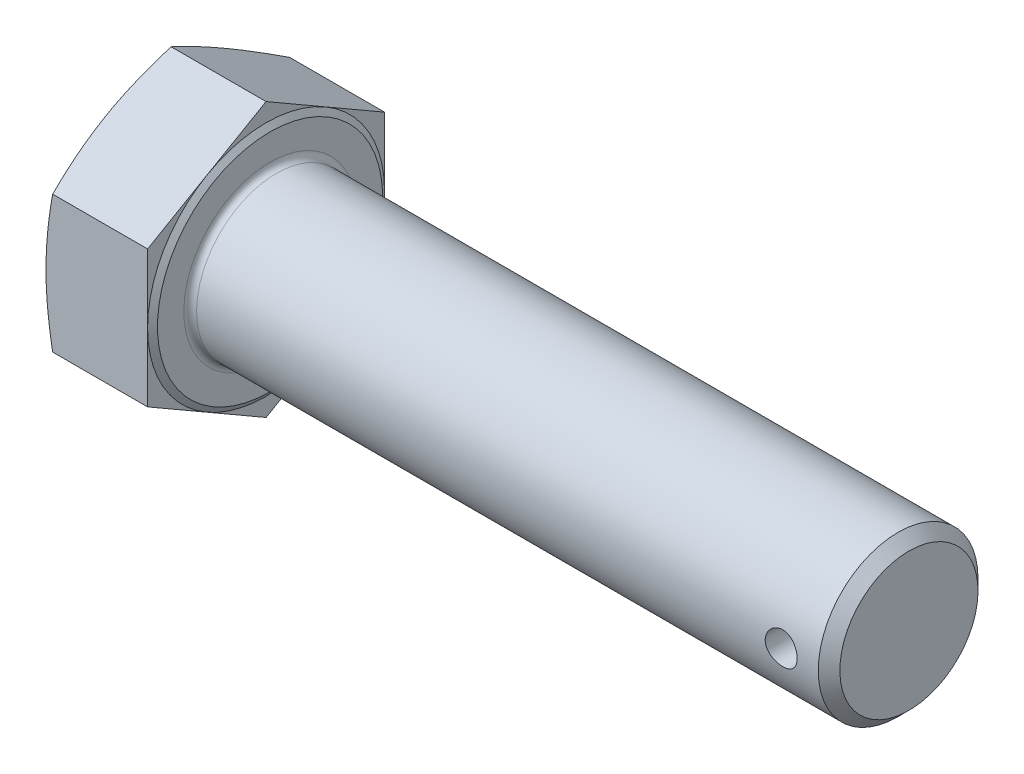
ISO-10303-21;
HEADER;
FILE_DESCRIPTION(('STEP AP214'),'2;1');
FILE_NAME('part.step','',(''),(''),'','','');
FILE_SCHEMA(('AUTOMOTIVE_DESIGN { 1 0 10303 214 1 1 1 1 }'));
ENDSEC;
DATA;
#1=APPLICATION_CONTEXT('core data for automotive mechanical design processes');
#2=APPLICATION_PROTOCOL_DEFINITION('international standard','automotive_design',2000,#1);
#3=PRODUCT_CONTEXT('',#1,'mechanical');
#4=PRODUCT('Part','Part','',(#3));
#5=PRODUCT_RELATED_PRODUCT_CATEGORY('part','',(#4));
#6=PRODUCT_DEFINITION_FORMATION('','',#4);
#7=PRODUCT_DEFINITION_CONTEXT('part definition',#1,'design');
#8=PRODUCT_DEFINITION('design','',#6,#7);
#9=PRODUCT_DEFINITION_SHAPE('','',#8);
#10=(LENGTH_UNIT() NAMED_UNIT(*) SI_UNIT(.MILLI.,.METRE.));
#11=(NAMED_UNIT(*) PLANE_ANGLE_UNIT() SI_UNIT($,.RADIAN.));
#12=(NAMED_UNIT(*) SI_UNIT($,.STERADIAN.) SOLID_ANGLE_UNIT());
#13=UNCERTAINTY_MEASURE_WITH_UNIT(LENGTH_MEASURE(1.E-05),#10,'distance_accuracy_value','');
#14=(GEOMETRIC_REPRESENTATION_CONTEXT(3) GLOBAL_UNCERTAINTY_ASSIGNED_CONTEXT((#13)) GLOBAL_UNIT_ASSIGNED_CONTEXT((#10,
#11,#12)) REPRESENTATION_CONTEXT('',''));
#15=CARTESIAN_POINT('',(0.,0.,0.));
#16=DIRECTION('',(0.,0.,1.));
#17=DIRECTION('',(1.,0.,0.));
#18=AXIS2_PLACEMENT_3D('',#15,#16,#17);
#19=CARTESIAN_POINT('',(13.22,0.,0.));
#20=DIRECTION('',(-1.,0.,0.));
#21=DIRECTION('',(0.,-1.,0.));
#22=AXIS2_PLACEMENT_3D('',#19,#20,#21);
#23=PLANE('',#22);
#24=CARTESIAN_POINT('',(13.22,0.,0.));
#25=DIRECTION('',(-1.,0.,0.));
#26=DIRECTION('',(0.,-1.,0.));
#27=AXIS2_PLACEMENT_3D('',#24,#25,#26);
#28=CIRCLE('',#27,10.8);
#29=CARTESIAN_POINT('',(13.22,-10.8,0.));
#30=VERTEX_POINT('',#29);
#31=EDGE_CURVE('E11',#30,#30,#28,.T.);
#32=ORIENTED_EDGE('',*,*,#31,.T.);
#33=EDGE_LOOP('',(#32));
#34=FACE_BOUND('',#33,.T.);
#35=CARTESIAN_POINT('',(13.22,0.,0.));
#36=DIRECTION('',(-1.,0.,0.));
#37=DIRECTION('',(0.,-1.,0.));
#38=AXIS2_PLACEMENT_3D('',#35,#36,#37);
#39=CIRCLE('',#38,14.095);
#40=CARTESIAN_POINT('',(13.22,-14.095,0.));
#41=VERTEX_POINT('',#40);
#42=EDGE_CURVE('E145',#41,#41,#39,.T.);
#43=ORIENTED_EDGE('',*,*,#42,.F.);
#44=EDGE_LOOP('',(#43));
#45=FACE_BOUND('',#44,.T.);
#46=ADVANCED_FACE('F32',(#34,#45),#23,.F.);
#47=CARTESIAN_POINT('',(12.72,-17.1299824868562,0.));
#48=DIRECTION('',(1.,0.,0.));
#49=DIRECTION('',(0.,0.,-1.));
#50=AXIS2_PLACEMENT_3D('',#47,#48,#49);
#51=PLANE('',#50);
#52=DIRECTION('',(0.,-0.5,-0.866025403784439));
#53=VECTOR('',#52,1.);
#54=CARTESIAN_POINT('',(12.72,-8.56499124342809,14.835));
#55=LINE('',#54,#53);
#56=CARTESIAN_POINT('',(12.72,-8.56499124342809,14.835));
#57=VERTEX_POINT('',#56);
#58=CARTESIAN_POINT('',(12.72,-12.8474868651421,7.41750000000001));
#59=VERTEX_POINT('',#58);
#60=EDGE_CURVE('E144',#57,#59,#55,.T.);
#61=ORIENTED_EDGE('',*,*,#60,.T.);
#62=CARTESIAN_POINT('',(12.72,0.,0.));
#63=DIRECTION('',(-1.,0.,0.));
#64=DIRECTION('',(0.,-1.,0.));
#65=AXIS2_PLACEMENT_3D('',#62,#63,#64);
#66=CIRCLE('',#65,14.835);
#67=CARTESIAN_POINT('',(12.72,0.,14.835));
#68=VERTEX_POINT('',#67);
#69=EDGE_CURVE('E54',#59,#68,#66,.T.);
#70=ORIENTED_EDGE('',*,*,#69,.T.);
#71=DIRECTION('',(0.,-1.,0.));
#72=VECTOR('',#71,1.);
#73=CARTESIAN_POINT('',(12.72,8.56499124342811,14.835));
#74=LINE('',#73,#72);
#75=EDGE_CURVE('E141',#68,#57,#74,.T.);
#76=ORIENTED_EDGE('',*,*,#75,.T.);
#77=EDGE_LOOP('',(#61,#70,#76));
#78=FACE_BOUND('',#77,.T.);
#79=ADVANCED_FACE('F140',(#78),#51,.T.);
#80=CARTESIAN_POINT('',(12.72,8.56499124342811,14.835));
#81=VERTEX_POINT('',#80);
#82=EDGE_CURVE('E152',#81,#68,#74,.T.);
#83=ORIENTED_EDGE('',*,*,#82,.T.);
#84=CARTESIAN_POINT('',(12.72,12.8474868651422,7.4175));
#85=VERTEX_POINT('',#84);
#86=EDGE_CURVE('E127',#68,#85,#66,.T.);
#87=ORIENTED_EDGE('',*,*,#86,.T.);
#88=DIRECTION('',(0.,-0.5,0.866025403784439));
#89=VECTOR('',#88,1.);
#90=CARTESIAN_POINT('',(12.72,17.1299824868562,0.));
#91=LINE('',#90,#89);
#92=EDGE_CURVE('E158',#85,#81,#91,.T.);
#93=ORIENTED_EDGE('',*,*,#92,.T.);
#94=EDGE_LOOP('',(#83,#87,#93));
#95=FACE_BOUND('',#94,.T.);
#96=ADVANCED_FACE('F157',(#95),#51,.T.);
#97=CARTESIAN_POINT('',(12.72,17.1299824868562,0.));
#98=VERTEX_POINT('',#97);
#99=EDGE_CURVE('E155',#98,#85,#91,.T.);
#100=ORIENTED_EDGE('',*,*,#99,.T.);
#101=CARTESIAN_POINT('',(12.72,12.8474868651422,-7.4175));
#102=VERTEX_POINT('',#101);
#103=EDGE_CURVE('E131',#85,#102,#66,.T.);
#104=ORIENTED_EDGE('',*,*,#103,.T.);
#105=DIRECTION('',(0.,0.5,0.866025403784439));
#106=VECTOR('',#105,1.);
#107=CARTESIAN_POINT('',(12.72,8.56499124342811,-14.835));
#108=LINE('',#107,#106);
#109=EDGE_CURVE('E324',#102,#98,#108,.T.);
#110=ORIENTED_EDGE('',*,*,#109,.T.);
#111=EDGE_LOOP('',(#100,#104,#110));
#112=FACE_BOUND('',#111,.T.);
#113=ADVANCED_FACE('F336',(#112),#51,.T.);
#114=CARTESIAN_POINT('',(12.72,8.56499124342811,-14.835));
#115=VERTEX_POINT('',#114);
#116=EDGE_CURVE('E326',#115,#102,#108,.T.);
#117=ORIENTED_EDGE('',*,*,#116,.T.);
#118=CARTESIAN_POINT('',(12.72,0.,-14.835));
#119=VERTEX_POINT('',#118);
#120=EDGE_CURVE('E379',#102,#119,#66,.T.);
#121=ORIENTED_EDGE('',*,*,#120,.T.);
#122=DIRECTION('',(0.,1.,0.));
#123=VECTOR('',#122,1.);
#124=CARTESIAN_POINT('',(12.72,-8.5649912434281,-14.835));
#125=LINE('',#124,#123);
#126=EDGE_CURVE('E321',#119,#115,#125,.T.);
#127=ORIENTED_EDGE('',*,*,#126,.T.);
#128=EDGE_LOOP('',(#117,#121,#127));
#129=FACE_BOUND('',#128,.T.);
#130=ADVANCED_FACE('F380',(#129),#51,.T.);
#131=CARTESIAN_POINT('',(12.72,-8.5649912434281,-14.835));
#132=VERTEX_POINT('',#131);
#133=EDGE_CURVE('E319',#132,#119,#125,.T.);
#134=ORIENTED_EDGE('',*,*,#133,.T.);
#135=CARTESIAN_POINT('',(12.72,-12.8474868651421,-7.4175));
#136=VERTEX_POINT('',#135);
#137=EDGE_CURVE('E363',#119,#136,#66,.T.);
#138=ORIENTED_EDGE('',*,*,#137,.T.);
#139=DIRECTION('',(0.,0.5,-0.866025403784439));
#140=VECTOR('',#139,1.);
#141=CARTESIAN_POINT('',(12.72,-17.1299824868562,0.));
#142=LINE('',#141,#140);
#143=EDGE_CURVE('E377',#136,#132,#142,.T.);
#144=ORIENTED_EDGE('',*,*,#143,.T.);
#145=EDGE_LOOP('',(#134,#138,#144));
#146=FACE_BOUND('',#145,.T.);
#147=ADVANCED_FACE('F378',(#146),#51,.T.);
#148=CARTESIAN_POINT('',(12.72,-17.1299824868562,0.));
#149=VERTEX_POINT('',#148);
#150=EDGE_CURVE('E327',#149,#136,#142,.T.);
#151=ORIENTED_EDGE('',*,*,#150,.T.);
#152=EDGE_CURVE('E146',#136,#59,#66,.T.);
#153=ORIENTED_EDGE('',*,*,#152,.T.);
#154=EDGE_CURVE('E372',#59,#149,#55,.T.);
#155=ORIENTED_EDGE('',*,*,#154,.T.);
#156=EDGE_LOOP('',(#151,#153,#155));
#157=FACE_BOUND('',#156,.T.);
#158=ADVANCED_FACE('F224',(#157),#51,.T.);
#159=CARTESIAN_POINT('',(12.72,-8.56499124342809,14.835));
#160=DIRECTION('',(0.,0.866025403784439,-0.5));
#161=DIRECTION('',(0.,0.5,0.866025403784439));
#162=AXIS2_PLACEMENT_3D('',#159,#160,#161);
#163=PLANE('',#162);
#164=CARTESIAN_POINT('',(0.835347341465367,-17.13009795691,-0.000199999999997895));
#165=CARTESIAN_POINT('',(0.770791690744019,-16.9527208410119,0.307026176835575));
#166=CARTESIAN_POINT('',(0.709139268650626,-16.7750830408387,0.614703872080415));
#167=CARTESIAN_POINT('',(0.59227955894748,-16.4192618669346,1.2310042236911));
#168=CARTESIAN_POINT('',(0.537072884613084,-16.2410784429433,1.53962696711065));
#169=CARTESIAN_POINT('',(0.38202594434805,-15.7054773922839,2.46731519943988));
#170=CARTESIAN_POINT('',(0.292849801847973,-15.3472541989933,3.08777597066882));
#171=CARTESIAN_POINT('',(0.184472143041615,-14.81036895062,4.01768849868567));
#172=CARTESIAN_POINT('',(0.152669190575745,-14.632326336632,4.32606735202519));
#173=CARTESIAN_POINT('',(0.0977478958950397,-14.2759086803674,4.94340084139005));
#174=CARTESIAN_POINT('',(0.0746291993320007,-14.097533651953,5.25235545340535));
#175=CARTESIAN_POINT('',(0.0374802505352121,-13.7406079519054,5.87056890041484));
#176=CARTESIAN_POINT('',(0.0234468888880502,-13.5620573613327,6.17982759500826));
#177=CARTESIAN_POINT('',(0.00470677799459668,-13.2048334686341,6.79855752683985));
#178=CARTESIAN_POINT('',(0.,-13.0261601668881,7.10802876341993));
#179=CARTESIAN_POINT('',(0.,-12.6688135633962,7.72697123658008));
#180=CARTESIAN_POINT('',(0.00470677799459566,-12.4901402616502,8.03644247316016));
#181=CARTESIAN_POINT('',(0.0234468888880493,-12.1329163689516,8.65517240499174));
#182=CARTESIAN_POINT('',(0.037480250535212,-11.9543657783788,8.96443109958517));
#183=CARTESIAN_POINT('',(0.0746291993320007,-11.5974400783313,9.58264454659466));
#184=CARTESIAN_POINT('',(0.0977478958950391,-11.4190650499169,9.89159915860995));
#185=CARTESIAN_POINT('',(0.152669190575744,-11.0626473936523,10.5089326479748));
#186=CARTESIAN_POINT('',(0.184472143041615,-10.8846047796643,10.8173115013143));
#187=CARTESIAN_POINT('',(0.292849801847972,-10.347719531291,11.7472240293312));
#188=CARTESIAN_POINT('',(0.382025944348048,-9.98949633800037,12.3676848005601));
#189=CARTESIAN_POINT('',(0.537072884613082,-9.45389528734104,13.2953730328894));
#190=CARTESIAN_POINT('',(0.592279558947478,-9.27571186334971,13.6039957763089));
#191=CARTESIAN_POINT('',(0.709139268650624,-8.91989068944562,14.2202961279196));
#192=CARTESIAN_POINT('',(0.770791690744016,-8.74225288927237,14.5279738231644));
#193=CARTESIAN_POINT('',(0.835347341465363,-8.56487577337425,14.8352));
#194=B_SPLINE_CURVE_WITH_KNOTS('',3,(#164,#165,#166,#167,#168,#169,#170,#171,#172,#173,#174,
#175,#176,#177,#178,#179,#180,#181,#182,#183,#184,#185,#186,#187,#188,#189,#190,#191,#192,#193),
.UNSPECIFIED.,.F.,.F.,(4,2,2,2,2,2,2,2,2,2,2,2,2,2,4),(0.,1.08170811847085,2.16351907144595,
4.32863649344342,5.40105974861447,6.47343924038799,7.54545152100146,8.61746049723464,
9.68946947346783,10.7614817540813,11.8338612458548,12.9062845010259,15.0714019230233,
16.1532128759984,17.2349209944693),.UNSPECIFIED.);
#195=CARTESIAN_POINT('',(0.835305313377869,-17.1299824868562,0.));
#196=VERTEX_POINT('',#195);
#197=CARTESIAN_POINT('',(0.,-12.8474868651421,7.4175));
#198=VERTEX_POINT('',#197);
#199=EDGE_CURVE('E366',#196,#198,#194,.T.);
#200=ORIENTED_EDGE('',*,*,#199,.F.);
#201=DIRECTION('',(-1.,0.,0.));
#202=VECTOR('',#201,1.);
#203=CARTESIAN_POINT('',(12.72,-17.1299824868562,0.));
#204=LINE('',#203,#202);
#205=EDGE_CURVE('E175',#149,#196,#204,.T.);
#206=ORIENTED_EDGE('',*,*,#205,.F.);
#207=ORIENTED_EDGE('',*,*,#154,.F.);
#208=ORIENTED_EDGE('',*,*,#60,.F.);
#209=DIRECTION('',(-1.,0.,0.));
#210=VECTOR('',#209,1.);
#211=CARTESIAN_POINT('',(12.72,-8.56499124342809,14.835));
#212=LINE('',#211,#210);
#213=CARTESIAN_POINT('',(0.835305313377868,-8.56499124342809,14.835));
#214=VERTEX_POINT('',#213);
#215=EDGE_CURVE('E154',#57,#214,#212,.T.);
#216=ORIENTED_EDGE('',*,*,#215,.T.);
#217=EDGE_CURVE('E256',#198,#214,#194,.T.);
#218=ORIENTED_EDGE('',*,*,#217,.F.);
#219=EDGE_LOOP('',(#200,#206,#207,#208,#216,#218));
#220=FACE_BOUND('',#219,.T.);
#221=ADVANCED_FACE('F34',(#220),#163,.F.);
#222=CARTESIAN_POINT('',(12.72,-17.1299824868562,0.));
#223=DIRECTION('',(0.,0.866025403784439,0.5));
#224=DIRECTION('',(0.,-0.5,0.866025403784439));
#225=AXIS2_PLACEMENT_3D('',#222,#223,#224);
#226=PLANE('',#225);
#227=CARTESIAN_POINT('',(0.835347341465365,-8.56487577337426,-14.8352));
#228=CARTESIAN_POINT('',(0.770791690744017,-8.74225288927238,-14.5279738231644));
#229=CARTESIAN_POINT('',(0.709139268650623,-8.91989068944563,-14.2202961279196));
#230=CARTESIAN_POINT('',(0.592279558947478,-9.27571186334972,-13.6039957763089));
#231=CARTESIAN_POINT('',(0.537072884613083,-9.45389528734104,-13.2953730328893));
#232=CARTESIAN_POINT('',(0.382025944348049,-9.98949633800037,-12.3676848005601));
#233=CARTESIAN_POINT('',(0.292849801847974,-10.347719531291,-11.7472240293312));
#234=CARTESIAN_POINT('',(0.184472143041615,-10.8846047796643,-10.8173115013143));
#235=CARTESIAN_POINT('',(0.152669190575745,-11.0626473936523,-10.5089326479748));
#236=CARTESIAN_POINT('',(0.0977478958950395,-11.4190650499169,-9.89159915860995));
#237=CARTESIAN_POINT('',(0.0746291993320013,-11.5974400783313,-9.58264454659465));
#238=CARTESIAN_POINT('',(0.037480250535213,-11.9543657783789,-8.96443109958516));
#239=CARTESIAN_POINT('',(0.0234468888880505,-12.1329163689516,-8.65517240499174));
#240=CARTESIAN_POINT('',(0.00470677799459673,-12.4901402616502,-8.03644247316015));
#241=CARTESIAN_POINT('',(0.,-12.6688135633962,-7.72697123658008));
#242=CARTESIAN_POINT('',(0.,-13.0261601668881,-7.10802876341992));
#243=CARTESIAN_POINT('',(0.00470677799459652,-13.2048334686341,-6.79855752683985));
#244=CARTESIAN_POINT('',(0.0234468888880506,-13.5620573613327,-6.17982759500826));
#245=CARTESIAN_POINT('',(0.0374802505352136,-13.7406079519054,-5.87056890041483));
#246=CARTESIAN_POINT('',(0.074629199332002,-14.097533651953,-5.25235545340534));
#247=CARTESIAN_POINT('',(0.0977478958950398,-14.2759086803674,-4.94340084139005));
#248=CARTESIAN_POINT('',(0.152669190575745,-14.632326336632,-4.32606735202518));
#249=CARTESIAN_POINT('',(0.184472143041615,-14.81036895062,-4.01768849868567));
#250=CARTESIAN_POINT('',(0.292849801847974,-15.3472541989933,-3.08777597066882));
#251=CARTESIAN_POINT('',(0.38202594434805,-15.7054773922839,-2.46731519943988));
#252=CARTESIAN_POINT('',(0.537072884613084,-16.2410784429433,-1.53962696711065));
#253=CARTESIAN_POINT('',(0.59227955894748,-16.4192618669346,-1.2310042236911));
#254=CARTESIAN_POINT('',(0.709139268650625,-16.7750830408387,-0.614703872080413));
#255=CARTESIAN_POINT('',(0.770791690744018,-16.9527208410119,-0.307026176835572));
#256=CARTESIAN_POINT('',(0.835347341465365,-17.13009795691,0.000200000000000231));
#257=B_SPLINE_CURVE_WITH_KNOTS('',3,(#227,#228,#229,#230,#231,#232,#233,#234,#235,#236,#237,
#238,#239,#240,#241,#242,#243,#244,#245,#246,#247,#248,#249,#250,#251,#252,#253,#254,#255,#256),
.UNSPECIFIED.,.F.,.F.,(4,2,2,2,2,2,2,2,2,2,2,2,2,2,4),(0.,1.08170811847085,2.16351907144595,
4.32863649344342,5.40105974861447,6.47343924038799,7.54545152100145,8.61746049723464,
9.68946947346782,10.7614817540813,11.8338612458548,12.9062845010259,15.0714019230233,
16.1532128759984,17.2349209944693),.UNSPECIFIED.);
#258=CARTESIAN_POINT('',(0.835305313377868,-8.56499124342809,-14.835));
#259=VERTEX_POINT('',#258);
#260=CARTESIAN_POINT('',(0.,-12.8474868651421,-7.4175));
#261=VERTEX_POINT('',#260);
#262=EDGE_CURVE('E270',#259,#261,#257,.T.);
#263=ORIENTED_EDGE('',*,*,#262,.F.);
#264=DIRECTION('',(-1.,0.,0.));
#265=VECTOR('',#264,1.);
#266=CARTESIAN_POINT('',(12.72,-8.5649912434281,-14.835));
#267=LINE('',#266,#265);
#268=EDGE_CURVE('E172',#132,#259,#267,.T.);
#269=ORIENTED_EDGE('',*,*,#268,.F.);
#270=ORIENTED_EDGE('',*,*,#143,.F.);
#271=ORIENTED_EDGE('',*,*,#150,.F.);
#272=ORIENTED_EDGE('',*,*,#205,.T.);
#273=EDGE_CURVE('E266',#261,#196,#257,.T.);
#274=ORIENTED_EDGE('',*,*,#273,.F.);
#275=EDGE_LOOP('',(#263,#269,#270,#271,#272,#274));
#276=FACE_BOUND('',#275,.T.);
#277=ADVANCED_FACE('F277',(#276),#226,.F.);
#278=CARTESIAN_POINT('',(12.72,-8.5649912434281,-14.835));
#279=DIRECTION('',(0.,0.,1.));
#280=DIRECTION('',(1.,0.,0.));
#281=AXIS2_PLACEMENT_3D('',#278,#279,#280);
#282=PLANE('',#281);
#283=CARTESIAN_POINT('',(4.46354033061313,-22.6770851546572,-14.835));
#284=CARTESIAN_POINT('',(4.36132694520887,-22.3414955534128,-14.835));
#285=CARTESIAN_POINT('',(4.25973169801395,-22.0057177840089,-14.835));
#286=CARTESIAN_POINT('',(4.05791586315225,-21.3337473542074,-14.835));
#287=CARTESIAN_POINT('',(3.95769528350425,-20.997554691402,-14.835));
#288=CARTESIAN_POINT('',(3.65929019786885,-19.988252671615,-14.835));
#289=CARTESIAN_POINT('',(3.46337749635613,-19.3144688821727,-14.835));
#290=CARTESIAN_POINT('',(3.07864714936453,-17.9635142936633,-14.835));
#291=CARTESIAN_POINT('',(2.88984342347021,-17.2863395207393,-14.835));
#292=CARTESIAN_POINT('',(2.52152523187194,-15.9294713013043,-14.835));
#293=CARTESIAN_POINT('',(2.34201059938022,-15.2497779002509,-14.835));
#294=CARTESIAN_POINT('',(1.99671819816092,-13.8958180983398,-14.835));
#295=CARTESIAN_POINT('',(1.83079835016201,-13.2215881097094,-14.835));
#296=CARTESIAN_POINT('',(1.51308451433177,-11.8697731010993,-14.835));
#297=CARTESIAN_POINT('',(1.36129076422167,-11.1921880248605,-14.835));
#298=CARTESIAN_POINT('',(1.07536835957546,-9.83351119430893,-14.835));
#299=CARTESIAN_POINT('',(0.941233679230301,-9.15242071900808,-14.835));
#300=CARTESIAN_POINT('',(0.694713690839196,-7.78628556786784,-14.835));
#301=CARTESIAN_POINT('',(0.582327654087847,-7.10124102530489,-14.835));
#302=CARTESIAN_POINT('',(0.394998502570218,-5.80433644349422,-14.835));
#303=CARTESIAN_POINT('',(0.317270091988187,-5.19288250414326,-14.835));
#304=CARTESIAN_POINT('',(0.185694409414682,-3.96738909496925,-14.835));
#305=CARTESIAN_POINT('',(0.131846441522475,-3.35334970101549,-14.835));
#306=CARTESIAN_POINT('',(0.0506248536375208,-2.1239308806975,-14.835));
#307=CARTESIAN_POINT('',(0.0232325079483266,-1.5085527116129,-14.835));
#308=CARTESIAN_POINT('',(-0.00369096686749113,-0.277180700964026,-14.835));
#309=CARTESIAN_POINT('',(-0.00322229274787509,0.338813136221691,-14.835));
#310=CARTESIAN_POINT('',(0.0256237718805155,1.57326186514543,-14.835));
#311=CARTESIAN_POINT('',(0.0541426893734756,2.19171339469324,-14.835));
#312=CARTESIAN_POINT('',(0.137776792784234,3.42679990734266,-14.835));
#313=CARTESIAN_POINT('',(0.192892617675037,4.0434348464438,-14.835));
#314=CARTESIAN_POINT('',(0.327142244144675,5.27458369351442,-14.835));
#315=CARTESIAN_POINT('',(0.406296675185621,5.88909531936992,-14.835));
#316=CARTESIAN_POINT('',(0.585412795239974,7.11504431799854,-14.835));
#317=CARTESIAN_POINT('',(0.685374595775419,7.72648167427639,-14.835));
#318=CARTESIAN_POINT('',(0.908604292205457,8.97845707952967,-14.835));
#319=CARTESIAN_POINT('',(1.03282528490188,9.6188236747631,-14.835));
#320=CARTESIAN_POINT('',(1.2972552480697,10.8962684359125,-14.835));
#321=CARTESIAN_POINT('',(1.43746542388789,11.5333463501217,-14.835));
#322=CARTESIAN_POINT('',(1.73092962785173,12.8046677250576,-14.835));
#323=CARTESIAN_POINT('',(1.8841874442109,13.4389103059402,-14.835));
#324=CARTESIAN_POINT('',(2.20125387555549,14.7047236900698,-14.835));
#325=CARTESIAN_POINT('',(2.36506223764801,15.3362945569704,-14.835));
#326=CARTESIAN_POINT('',(2.70147349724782,16.5979501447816,-14.835));
#327=CARTESIAN_POINT('',(2.87408741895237,17.2280319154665,-14.835));
#328=CARTESIAN_POINT('',(3.22633703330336,18.4862269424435,-14.835));
#329=CARTESIAN_POINT('',(3.40597275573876,19.1143401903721,-14.835));
#330=CARTESIAN_POINT('',(3.77098067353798,20.3687797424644,-14.835));
#331=CARTESIAN_POINT('',(3.95635190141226,20.995106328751,-14.835));
#332=CARTESIAN_POINT('',(4.33186328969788,22.2463243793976,-14.835));
#333=CARTESIAN_POINT('',(4.52200343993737,22.8712158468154,-14.835));
#334=CARTESIAN_POINT('',(4.90413575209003,24.1128810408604,-14.835));
#335=CARTESIAN_POINT('',(5.09608428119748,24.7296682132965,-14.835));
#336=CARTESIAN_POINT('',(5.4832549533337,25.9622149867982,-14.835));
#337=CARTESIAN_POINT('',(5.67847710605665,26.5779745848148,-14.835));
#338=CARTESIAN_POINT('',(6.26829610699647,28.42398494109,-14.835));
#339=CARTESIAN_POINT('',(6.66702905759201,29.6529141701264,-14.835));
#340=CARTESIAN_POINT('',(7.47100797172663,32.1034680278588,-14.835));
#341=CARTESIAN_POINT('',(7.876223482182,33.3251026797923,-14.835));
#342=CARTESIAN_POINT('',(8.48854586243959,35.1559925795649,-14.835));
#343=CARTESIAN_POINT('',(8.69339483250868,35.7660043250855,-14.835));
#344=CARTESIAN_POINT('',(9.1044182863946,36.9855795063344,-14.835));
#345=CARTESIAN_POINT('',(9.31059276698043,37.5951429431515,-14.835));
#346=CARTESIAN_POINT('',(9.51734078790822,38.2045116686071,-14.835));
#347=B_SPLINE_CURVE_WITH_KNOTS('',3,(#283,#284,#285,#286,#287,#288,#289,#290,#291,#292,#293,
#294,#295,#296,#297,#298,#299,#300,#301,#302,#303,#304,#305,#306,#307,#308,#309,#310,#311,#312,
#313,#314,#315,#316,#317,#318,#319,#320,#321,#322,#323,#324,#325,#326,#327,#328,#329,#330,#331,
#332,#333,#334,#335,#336,#337,#338,#339,#340,#341,#342,#343,#344,#345,#346),.UNSPECIFIED.,.F.,
.F.,(4,2,2,2,2,2,2,2,2,2,2,2,2,2,2,2,2,2,2,2,2,2,2,2,2,2,2,2,2,2,2,4),(0.,1.05243016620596,
2.10486646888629,4.20989465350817,6.31885029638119,8.42776805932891,10.5106839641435,
12.593634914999,14.6758732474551,16.7580418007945,18.6067595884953,20.4554234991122,
22.3027779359,24.1501193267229,26.0068295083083,27.8635842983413,29.7219370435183,
31.5802997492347,33.5369608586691,35.4937695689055,37.4511483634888,39.4084802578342,
41.3683258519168,43.3281797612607,45.287704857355,47.2472257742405,49.1851096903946,
51.1229993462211,54.9989453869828,58.8601847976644,60.7906489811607,62.7211084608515),.UNSPECIFIED.);
#348=CARTESIAN_POINT('',(0.835305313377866,8.56499124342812,-14.835));
#349=VERTEX_POINT('',#348);
#350=CARTESIAN_POINT('',(0.,0.,-14.835));
#351=VERTEX_POINT('',#350);
#352=EDGE_CURVE('E311',#349,#351,#347,.F.);
#353=ORIENTED_EDGE('',*,*,#352,.F.);
#354=DIRECTION('',(-1.,0.,0.));
#355=VECTOR('',#354,1.);
#356=CARTESIAN_POINT('',(12.72,8.56499124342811,-14.835));
#357=LINE('',#356,#355);
#358=EDGE_CURVE('E169',#115,#349,#357,.T.);
#359=ORIENTED_EDGE('',*,*,#358,.F.);
#360=ORIENTED_EDGE('',*,*,#126,.F.);
#361=ORIENTED_EDGE('',*,*,#133,.F.);
#362=ORIENTED_EDGE('',*,*,#268,.T.);
#363=EDGE_CURVE('E271',#351,#259,#347,.F.);
#364=ORIENTED_EDGE('',*,*,#363,.F.);
#365=EDGE_LOOP('',(#353,#359,#360,#361,#362,#364));
#366=FACE_BOUND('',#365,.T.);
#367=ADVANCED_FACE('F280',(#366),#282,.F.);
#368=CARTESIAN_POINT('',(12.72,8.56499124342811,-14.835));
#369=DIRECTION('',(0.,-0.866025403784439,0.5));
#370=DIRECTION('',(0.,-0.5,-0.866025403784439));
#371=AXIS2_PLACEMENT_3D('',#368,#369,#370);
#372=PLANE('',#371);
#373=CARTESIAN_POINT('',(0.835347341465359,17.13009795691,0.000199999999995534));
#374=CARTESIAN_POINT('',(0.770791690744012,16.9527208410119,-0.307026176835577));
#375=CARTESIAN_POINT('',(0.709139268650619,16.7750830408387,-0.614703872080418));
#376=CARTESIAN_POINT('',(0.592279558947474,16.4192618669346,-1.2310042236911));
#377=CARTESIAN_POINT('',(0.537072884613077,16.2410784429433,-1.53962696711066));
#378=CARTESIAN_POINT('',(0.382025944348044,15.7054773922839,-2.46731519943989));
#379=CARTESIAN_POINT('',(0.292849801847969,15.3472541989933,-3.08777597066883));
#380=CARTESIAN_POINT('',(0.184472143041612,14.81036895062,-4.01768849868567));
#381=CARTESIAN_POINT('',(0.152669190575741,14.632326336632,-4.32606735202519));
#382=CARTESIAN_POINT('',(0.0977478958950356,14.2759086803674,-4.94340084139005));
#383=CARTESIAN_POINT('',(0.0746291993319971,14.097533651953,-5.25235545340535));
#384=CARTESIAN_POINT('',(0.0374802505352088,13.7406079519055,-5.87056890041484));
#385=CARTESIAN_POINT('',(0.0234468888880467,13.5620573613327,-6.17982759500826));
#386=CARTESIAN_POINT('',(0.00470677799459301,13.2048334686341,-6.79855752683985));
#387=CARTESIAN_POINT('',(0.,13.0261601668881,-7.10802876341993));
#388=CARTESIAN_POINT('',(0.,12.6688135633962,-7.72697123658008));
#389=CARTESIAN_POINT('',(0.00470677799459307,12.4901402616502,-8.03644247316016));
#390=CARTESIAN_POINT('',(0.0234468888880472,12.1329163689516,-8.65517240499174));
#391=CARTESIAN_POINT('',(0.0374802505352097,11.9543657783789,-8.96443109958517));
#392=CARTESIAN_POINT('',(0.0746291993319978,11.5974400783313,-9.58264454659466));
#393=CARTESIAN_POINT('',(0.0977478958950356,11.4190650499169,-9.89159915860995));
#394=CARTESIAN_POINT('',(0.152669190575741,11.0626473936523,-10.5089326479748));
#395=CARTESIAN_POINT('',(0.184472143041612,10.8846047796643,-10.8173115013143));
#396=CARTESIAN_POINT('',(0.292849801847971,10.347719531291,-11.7472240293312));
#397=CARTESIAN_POINT('',(0.382025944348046,9.98949633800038,-12.3676848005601));
#398=CARTESIAN_POINT('',(0.53707288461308,9.45389528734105,-13.2953730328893));
#399=CARTESIAN_POINT('',(0.592279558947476,9.27571186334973,-13.6039957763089));
#400=CARTESIAN_POINT('',(0.709139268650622,8.91989068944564,-14.2202961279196));
#401=CARTESIAN_POINT('',(0.770791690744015,8.74225288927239,-14.5279738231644));
#402=CARTESIAN_POINT('',(0.835347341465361,8.56487577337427,-14.8352));
#403=B_SPLINE_CURVE_WITH_KNOTS('',3,(#373,#374,#375,#376,#377,#378,#379,#380,#381,#382,#383,
#384,#385,#386,#387,#388,#389,#390,#391,#392,#393,#394,#395,#396,#397,#398,#399,#400,#401,#402),
.UNSPECIFIED.,.F.,.F.,(4,2,2,2,2,2,2,2,2,2,2,2,2,2,4),(0.,1.08170811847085,2.16351907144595,
4.32863649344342,5.40105974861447,6.47343924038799,7.54545152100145,8.61746049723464,
9.68946947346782,10.7614817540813,11.8338612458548,12.9062845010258,15.0714019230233,
16.1532128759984,17.2349209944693),.UNSPECIFIED.);
#404=CARTESIAN_POINT('',(0.835305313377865,17.1299824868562,0.));
#405=VERTEX_POINT('',#404);
#406=CARTESIAN_POINT('',(0.,12.8474868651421,-7.4175));
#407=VERTEX_POINT('',#406);
#408=EDGE_CURVE('E62',#405,#407,#403,.T.);
#409=ORIENTED_EDGE('',*,*,#408,.F.);
#410=DIRECTION('',(-1.,0.,0.));
#411=VECTOR('',#410,1.);
#412=CARTESIAN_POINT('',(12.72,17.1299824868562,0.));
#413=LINE('',#412,#411);
#414=EDGE_CURVE('E166',#98,#405,#413,.T.);
#415=ORIENTED_EDGE('',*,*,#414,.F.);
#416=ORIENTED_EDGE('',*,*,#109,.F.);
#417=ORIENTED_EDGE('',*,*,#116,.F.);
#418=ORIENTED_EDGE('',*,*,#358,.T.);
#419=EDGE_CURVE('E312',#407,#349,#403,.T.);
#420=ORIENTED_EDGE('',*,*,#419,.F.);
#421=EDGE_LOOP('',(#409,#415,#416,#417,#418,#420));
#422=FACE_BOUND('',#421,.T.);
#423=ADVANCED_FACE('F284',(#422),#372,.F.);
#424=CARTESIAN_POINT('',(12.72,17.1299824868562,0.));
#425=DIRECTION('',(0.,-0.866025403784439,-0.5));
#426=DIRECTION('',(0.,0.5,-0.866025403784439));
#427=AXIS2_PLACEMENT_3D('',#424,#425,#426);
#428=PLANE('',#427);
#429=CARTESIAN_POINT('',(0.835347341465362,8.56487577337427,14.8352));
#430=CARTESIAN_POINT('',(0.770791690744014,8.74225288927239,14.5279738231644));
#431=CARTESIAN_POINT('',(0.70913926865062,8.91989068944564,14.2202961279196));
#432=CARTESIAN_POINT('',(0.592279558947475,9.27571186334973,13.6039957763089));
#433=CARTESIAN_POINT('',(0.537072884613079,9.45389528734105,13.2953730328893));
#434=CARTESIAN_POINT('',(0.382025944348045,9.98949633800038,12.3676848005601));
#435=CARTESIAN_POINT('',(0.292849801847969,10.347719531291,11.7472240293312));
#436=CARTESIAN_POINT('',(0.184472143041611,10.8846047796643,10.8173115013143));
#437=CARTESIAN_POINT('',(0.15266919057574,11.0626473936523,10.5089326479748));
#438=CARTESIAN_POINT('',(0.0977478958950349,11.4190650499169,9.89159915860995));
#439=CARTESIAN_POINT('',(0.0746291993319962,11.5974400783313,9.58264454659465));
#440=CARTESIAN_POINT('',(0.0374802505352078,11.9543657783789,8.96443109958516));
#441=CARTESIAN_POINT('',(0.0234468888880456,12.1329163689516,8.65517240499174));
#442=CARTESIAN_POINT('',(0.0047067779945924,12.4901402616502,8.03644247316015));
#443=CARTESIAN_POINT('',(0.,12.6688135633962,7.72697123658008));
#444=CARTESIAN_POINT('',(0.,13.0261601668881,7.10802876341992));
#445=CARTESIAN_POINT('',(0.00470677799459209,13.2048334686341,6.79855752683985));
#446=CARTESIAN_POINT('',(0.0234468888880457,13.5620573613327,6.17982759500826));
#447=CARTESIAN_POINT('',(0.0374802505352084,13.7406079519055,5.87056890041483));
#448=CARTESIAN_POINT('',(0.0746291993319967,14.097533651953,5.25235545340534));
#449=CARTESIAN_POINT('',(0.0977478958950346,14.2759086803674,4.94340084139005));
#450=CARTESIAN_POINT('',(0.15266919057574,14.632326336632,4.32606735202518));
#451=CARTESIAN_POINT('',(0.184472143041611,14.81036895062,4.01768849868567));
#452=CARTESIAN_POINT('',(0.292849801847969,15.3472541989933,3.08777597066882));
#453=CARTESIAN_POINT('',(0.382025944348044,15.7054773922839,2.46731519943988));
#454=CARTESIAN_POINT('',(0.537072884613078,16.2410784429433,1.53962696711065));
#455=CARTESIAN_POINT('',(0.592279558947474,16.4192618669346,1.23100422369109));
#456=CARTESIAN_POINT('',(0.70913926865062,16.7750830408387,0.614703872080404));
#457=CARTESIAN_POINT('',(0.770791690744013,16.9527208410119,0.307026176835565));
#458=CARTESIAN_POINT('',(0.835347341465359,17.13009795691,-0.000200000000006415));
#459=B_SPLINE_CURVE_WITH_KNOTS('',3,(#429,#430,#431,#432,#433,#434,#435,#436,#437,#438,#439,
#440,#441,#442,#443,#444,#445,#446,#447,#448,#449,#450,#451,#452,#453,#454,#455,#456,#457,#458),
.UNSPECIFIED.,.F.,.F.,(4,2,2,2,2,2,2,2,2,2,2,2,2,2,4),(0.,1.08170811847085,2.16351907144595,
4.32863649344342,5.40105974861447,6.47343924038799,7.54545152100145,8.61746049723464,
9.68946947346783,10.7614817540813,11.8338612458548,12.9062845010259,15.0714019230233,
16.1532128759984,17.2349209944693),.UNSPECIFIED.);
#460=CARTESIAN_POINT('',(0.835305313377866,8.5649912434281,14.835));
#461=VERTEX_POINT('',#460);
#462=CARTESIAN_POINT('',(0.,12.8474868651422,7.41749999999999));
#463=VERTEX_POINT('',#462);
#464=EDGE_CURVE('E249',#461,#463,#459,.T.);
#465=ORIENTED_EDGE('',*,*,#464,.F.);
#466=DIRECTION('',(-1.,0.,0.));
#467=VECTOR('',#466,1.);
#468=CARTESIAN_POINT('',(12.72,8.56499124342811,14.835));
#469=LINE('',#468,#467);
#470=EDGE_CURVE('E160',#81,#461,#469,.T.);
#471=ORIENTED_EDGE('',*,*,#470,.F.);
#472=ORIENTED_EDGE('',*,*,#92,.F.);
#473=ORIENTED_EDGE('',*,*,#99,.F.);
#474=ORIENTED_EDGE('',*,*,#414,.T.);
#475=EDGE_CURVE('E371',#463,#405,#459,.T.);
#476=ORIENTED_EDGE('',*,*,#475,.F.);
#477=EDGE_LOOP('',(#465,#471,#472,#473,#474,#476));
#478=FACE_BOUND('',#477,.T.);
#479=ADVANCED_FACE('F288',(#478),#428,.F.);
#480=CARTESIAN_POINT('',(12.72,8.56499124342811,14.835));
#481=DIRECTION('',(0.,0.,-1.));
#482=DIRECTION('',(-1.,0.,0.));
#483=AXIS2_PLACEMENT_3D('',#480,#481,#482);
#484=PLANE('',#483);
#485=CARTESIAN_POINT('',(4.46354033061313,-22.6770851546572,14.835));
#486=CARTESIAN_POINT('',(4.36132694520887,-22.3414955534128,14.835));
#487=CARTESIAN_POINT('',(4.25973169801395,-22.0057177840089,14.835));
#488=CARTESIAN_POINT('',(4.05791586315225,-21.3337473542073,14.835));
#489=CARTESIAN_POINT('',(3.95769528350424,-20.997554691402,14.835));
#490=CARTESIAN_POINT('',(3.65929019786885,-19.988252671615,14.835));
#491=CARTESIAN_POINT('',(3.46337749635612,-19.3144688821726,14.835));
#492=CARTESIAN_POINT('',(3.07864714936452,-17.9635142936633,14.835));
#493=CARTESIAN_POINT('',(2.8898434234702,-17.2863395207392,14.835));
#494=CARTESIAN_POINT('',(2.52152523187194,-15.9294713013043,14.835));
#495=CARTESIAN_POINT('',(2.34201059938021,-15.2497779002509,14.835));
#496=CARTESIAN_POINT('',(1.99671819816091,-13.8958180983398,14.835));
#497=CARTESIAN_POINT('',(1.83079835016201,-13.2215881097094,14.835));
#498=CARTESIAN_POINT('',(1.51308451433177,-11.8697731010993,14.835));
#499=CARTESIAN_POINT('',(1.36129076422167,-11.1921880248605,14.835));
#500=CARTESIAN_POINT('',(1.07536835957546,-9.83351119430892,14.835));
#501=CARTESIAN_POINT('',(0.9412336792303,-9.15242071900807,14.835));
#502=CARTESIAN_POINT('',(0.694713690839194,-7.78628556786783,14.835));
#503=CARTESIAN_POINT('',(0.582327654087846,-7.10124102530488,14.835));
#504=CARTESIAN_POINT('',(0.394998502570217,-5.80433644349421,14.835));
#505=CARTESIAN_POINT('',(0.317270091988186,-5.19288250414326,14.835));
#506=CARTESIAN_POINT('',(0.185694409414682,-3.96738909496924,14.835));
#507=CARTESIAN_POINT('',(0.131846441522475,-3.35334970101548,14.835));
#508=CARTESIAN_POINT('',(0.0506248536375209,-2.12393088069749,14.835));
#509=CARTESIAN_POINT('',(0.0232325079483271,-1.50855271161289,14.835));
#510=CARTESIAN_POINT('',(-0.00369096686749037,-0.277180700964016,14.835));
#511=CARTESIAN_POINT('',(-0.00322229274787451,0.338813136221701,14.835));
#512=CARTESIAN_POINT('',(0.0256237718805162,1.57326186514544,14.835));
#513=CARTESIAN_POINT('',(0.0541426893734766,2.19171339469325,14.835));
#514=CARTESIAN_POINT('',(0.137776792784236,3.42679990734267,14.835));
#515=CARTESIAN_POINT('',(0.192892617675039,4.04343484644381,14.835));
#516=CARTESIAN_POINT('',(0.327142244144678,5.27458369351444,14.835));
#517=CARTESIAN_POINT('',(0.406296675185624,5.88909531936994,14.835));
#518=CARTESIAN_POINT('',(0.585412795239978,7.11504431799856,14.835));
#519=CARTESIAN_POINT('',(0.685374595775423,7.72648167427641,14.835));
#520=CARTESIAN_POINT('',(0.908604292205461,8.97845707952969,14.835));
#521=CARTESIAN_POINT('',(1.03282528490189,9.61882367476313,14.835));
#522=CARTESIAN_POINT('',(1.2972552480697,10.8962684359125,14.835));
#523=CARTESIAN_POINT('',(1.4374654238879,11.5333463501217,14.835));
#524=CARTESIAN_POINT('',(1.73092962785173,12.8046677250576,14.835));
#525=CARTESIAN_POINT('',(1.88418744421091,13.4389103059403,14.835));
#526=CARTESIAN_POINT('',(2.2012538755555,14.7047236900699,14.835));
#527=CARTESIAN_POINT('',(2.36506223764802,15.3362945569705,14.835));
#528=CARTESIAN_POINT('',(2.70147349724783,16.5979501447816,14.835));
#529=CARTESIAN_POINT('',(2.87408741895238,17.2280319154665,14.835));
#530=CARTESIAN_POINT('',(3.22633703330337,18.4862269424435,14.835));
#531=CARTESIAN_POINT('',(3.40597275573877,19.1143401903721,14.835));
#532=CARTESIAN_POINT('',(3.77098067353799,20.3687797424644,14.835));
#533=CARTESIAN_POINT('',(3.95635190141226,20.995106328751,14.835));
#534=CARTESIAN_POINT('',(4.33186328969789,22.2463243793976,14.835));
#535=CARTESIAN_POINT('',(4.52200343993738,22.8712158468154,14.835));
#536=CARTESIAN_POINT('',(4.90413575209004,24.1128810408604,14.835));
#537=CARTESIAN_POINT('',(5.09608428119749,24.7296682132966,14.835));
#538=CARTESIAN_POINT('',(5.48325495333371,25.9622149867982,14.835));
#539=CARTESIAN_POINT('',(5.67847710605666,26.5779745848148,14.835));
#540=CARTESIAN_POINT('',(6.26829610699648,28.42398494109,14.835));
#541=CARTESIAN_POINT('',(6.66702905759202,29.6529141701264,14.835));
#542=CARTESIAN_POINT('',(7.47100797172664,32.1034680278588,14.835));
#543=CARTESIAN_POINT('',(7.876223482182,33.3251026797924,14.835));
#544=CARTESIAN_POINT('',(8.48854586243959,35.1559925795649,14.835));
#545=CARTESIAN_POINT('',(8.69339483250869,35.7660043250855,14.835));
#546=CARTESIAN_POINT('',(9.1044182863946,36.9855795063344,14.835));
#547=CARTESIAN_POINT('',(9.31059276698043,37.5951429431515,14.835));
#548=CARTESIAN_POINT('',(9.51734078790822,38.2045116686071,14.835));
#549=B_SPLINE_CURVE_WITH_KNOTS('',3,(#485,#486,#487,#488,#489,#490,#491,#492,#493,#494,#495,
#496,#497,#498,#499,#500,#501,#502,#503,#504,#505,#506,#507,#508,#509,#510,#511,#512,#513,#514,
#515,#516,#517,#518,#519,#520,#521,#522,#523,#524,#525,#526,#527,#528,#529,#530,#531,#532,#533,
#534,#535,#536,#537,#538,#539,#540,#541,#542,#543,#544,#545,#546,#547,#548),.UNSPECIFIED.,.F.,
.F.,(4,2,2,2,2,2,2,2,2,2,2,2,2,2,2,2,2,2,2,2,2,2,2,2,2,2,2,2,2,2,2,4),(0.,1.05243016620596,
2.10486646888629,4.20989465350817,6.31885029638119,8.42776805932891,10.5106839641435,
12.593634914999,14.6758732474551,16.7580418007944,18.6067595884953,20.4554234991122,
22.3027779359,24.1501193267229,26.0068295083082,27.8635842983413,29.7219370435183,
31.5802997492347,33.5369608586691,35.4937695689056,37.4511483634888,39.4084802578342,
41.3683258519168,43.3281797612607,45.2877048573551,47.2472257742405,49.1851096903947,
51.1229993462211,54.9989453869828,58.8601847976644,60.7906489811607,62.7211084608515),.UNSPECIFIED.);
#550=CARTESIAN_POINT('',(0.,0.,14.835));
#551=VERTEX_POINT('',#550);
#552=EDGE_CURVE('E343',#214,#551,#549,.T.);
#553=ORIENTED_EDGE('',*,*,#552,.F.);
#554=ORIENTED_EDGE('',*,*,#215,.F.);
#555=ORIENTED_EDGE('',*,*,#75,.F.);
#556=ORIENTED_EDGE('',*,*,#82,.F.);
#557=ORIENTED_EDGE('',*,*,#470,.T.);
#558=EDGE_CURVE('E239',#551,#461,#549,.T.);
#559=ORIENTED_EDGE('',*,*,#558,.F.);
#560=EDGE_LOOP('',(#553,#554,#555,#556,#557,#559));
#561=FACE_BOUND('',#560,.T.);
#562=ADVANCED_FACE('F150',(#561),#484,.F.);
#563=CARTESIAN_POINT('',(0.,0.,0.));
#564=DIRECTION('',(1.,0.,0.));
#565=DIRECTION('',(0.,1.,0.));
#566=AXIS2_PLACEMENT_3D('',#563,#564,#565);
#567=CONICAL_SURFACE('',#566,14.835,1.22173047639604);
#568=ORIENTED_EDGE('',*,*,#363,.T.);
#569=ORIENTED_EDGE('',*,*,#262,.T.);
#570=CARTESIAN_POINT('',(0.,0.,0.));
#571=DIRECTION('',(1.,0.,0.));
#572=DIRECTION('',(0.,0.,-1.));
#573=AXIS2_PLACEMENT_3D('',#570,#571,#572);
#574=CIRCLE('',#573,14.835);
#575=EDGE_CURVE('E178',#261,#351,#574,.T.);
#576=ORIENTED_EDGE('',*,*,#575,.T.);
#577=EDGE_LOOP('',(#568,#569,#576));
#578=FACE_BOUND('',#577,.T.);
#579=ADVANCED_FACE('F234',(#578),#567,.T.);
#580=ORIENTED_EDGE('',*,*,#273,.T.);
#581=ORIENTED_EDGE('',*,*,#199,.T.);
#582=EDGE_CURVE('E181',#198,#261,#574,.T.);
#583=ORIENTED_EDGE('',*,*,#582,.T.);
#584=EDGE_LOOP('',(#580,#581,#583));
#585=FACE_BOUND('',#584,.T.);
#586=ADVANCED_FACE('F298',(#585),#567,.T.);
#587=ORIENTED_EDGE('',*,*,#217,.T.);
#588=ORIENTED_EDGE('',*,*,#552,.T.);
#589=CARTESIAN_POINT('',(0.,0.,0.));
#590=DIRECTION('',(-1.,0.,0.));
#591=DIRECTION('',(0.,-1.,0.));
#592=AXIS2_PLACEMENT_3D('',#589,#590,#591);
#593=CIRCLE('',#592,14.835);
#594=EDGE_CURVE('E346',#198,#551,#593,.T.);
#595=ORIENTED_EDGE('',*,*,#594,.F.);
#596=EDGE_LOOP('',(#587,#588,#595));
#597=FACE_BOUND('',#596,.T.);
#598=ADVANCED_FACE('F303',(#597),#567,.T.);
#599=ORIENTED_EDGE('',*,*,#464,.T.);
#600=EDGE_CURVE('E364',#463,#551,#574,.T.);
#601=ORIENTED_EDGE('',*,*,#600,.T.);
#602=ORIENTED_EDGE('',*,*,#558,.T.);
#603=EDGE_LOOP('',(#599,#601,#602));
#604=FACE_BOUND('',#603,.T.);
#605=ADVANCED_FACE('F235',(#604),#567,.T.);
#606=ORIENTED_EDGE('',*,*,#408,.T.);
#607=EDGE_CURVE('E361',#407,#463,#574,.T.);
#608=ORIENTED_EDGE('',*,*,#607,.T.);
#609=ORIENTED_EDGE('',*,*,#475,.T.);
#610=EDGE_LOOP('',(#606,#608,#609));
#611=FACE_BOUND('',#610,.T.);
#612=ADVANCED_FACE('F232',(#611),#567,.T.);
#613=ORIENTED_EDGE('',*,*,#352,.T.);
#614=EDGE_CURVE('E182',#351,#407,#574,.T.);
#615=ORIENTED_EDGE('',*,*,#614,.T.);
#616=ORIENTED_EDGE('',*,*,#419,.T.);
#617=EDGE_LOOP('',(#613,#615,#616));
#618=FACE_BOUND('',#617,.T.);
#619=ADVANCED_FACE('F227',(#618),#567,.T.);
#620=CARTESIAN_POINT('',(0.,-17.1299824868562,0.));
#621=DIRECTION('',(1.,0.,0.));
#622=DIRECTION('',(0.,0.,-1.));
#623=AXIS2_PLACEMENT_3D('',#620,#621,#622);
#624=PLANE('',#623);
#625=ORIENTED_EDGE('',*,*,#614,.F.);
#626=ORIENTED_EDGE('',*,*,#575,.F.);
#627=ORIENTED_EDGE('',*,*,#582,.F.);
#628=ORIENTED_EDGE('',*,*,#594,.T.);
#629=ORIENTED_EDGE('',*,*,#600,.F.);
#630=ORIENTED_EDGE('',*,*,#607,.F.);
#631=EDGE_LOOP('',(#625,#626,#627,#628,#629,#630));
#632=FACE_BOUND('',#631,.T.);
#633=ADVANCED_FACE('F231',(#632),#624,.F.);
#634=CARTESIAN_POINT('',(13.22,0.,0.));
#635=DIRECTION('',(-1.,0.,0.));
#636=DIRECTION('',(0.,-1.,0.));
#637=AXIS2_PLACEMENT_3D('',#634,#635,#636);
#638=CONICAL_SURFACE('',#637,14.095,0.976582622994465);
#639=ORIENTED_EDGE('',*,*,#69,.F.);
#640=ORIENTED_EDGE('',*,*,#152,.F.);
#641=ORIENTED_EDGE('',*,*,#137,.F.);
#642=ORIENTED_EDGE('',*,*,#120,.F.);
#643=ORIENTED_EDGE('',*,*,#103,.F.);
#644=ORIENTED_EDGE('',*,*,#86,.F.);
#645=EDGE_LOOP('',(#639,#640,#641,#642,#643,#644));
#646=FACE_BOUND('',#645,.T.);
#647=ORIENTED_EDGE('',*,*,#42,.T.);
#648=EDGE_LOOP('',(#647));
#649=FACE_BOUND('',#648,.T.);
#650=ADVANCED_FACE('F128',(#646,#649),#638,.T.);
#651=CARTESIAN_POINT('',(93.22,0.,0.));
#652=DIRECTION('',(-1.,0.,0.));
#653=DIRECTION('',(0.,-1.,0.));
#654=AXIS2_PLACEMENT_3D('',#651,#652,#653);
#655=CYLINDRICAL_SURFACE('',#654,10.);
#656=CARTESIAN_POINT('',(89.22,0.,-10.));
#657=CARTESIAN_POINT('',(89.2199959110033,0.111153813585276,-9.99999795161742));
#658=CARTESIAN_POINT('',(89.2107023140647,0.222359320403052,-9.99812770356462));
#659=CARTESIAN_POINT('',(89.1738029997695,0.441627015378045,-9.99084731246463));
#660=CARTESIAN_POINT('',(89.146182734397,0.54968663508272,-9.98543435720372));
#661=CARTESIAN_POINT('',(89.0735174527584,0.759460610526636,-9.97167298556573));
#662=CARTESIAN_POINT('',(89.0284891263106,0.861180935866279,-9.96332738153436));
#663=CARTESIAN_POINT('',(88.9223355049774,1.05561597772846,-9.94460796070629));
#664=CARTESIAN_POINT('',(88.8612111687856,1.14833123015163,-9.93423426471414));
#665=CARTESIAN_POINT('',(88.7237230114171,1.32338695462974,-9.9124433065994));
#666=CARTESIAN_POINT('',(88.6471832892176,1.40558790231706,-9.90101491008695));
#667=CARTESIAN_POINT('',(88.4814151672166,1.55607351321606,-9.87848360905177));
#668=CARTESIAN_POINT('',(88.3921857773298,1.62435708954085,-9.86738073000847));
#669=CARTESIAN_POINT('',(88.2025676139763,1.74566350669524,-9.8466488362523));
#670=CARTESIAN_POINT('',(88.1020847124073,1.79854187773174,-9.83703414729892));
#671=CARTESIAN_POINT('',(87.8934363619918,1.88661133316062,-9.82052536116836));
#672=CARTESIAN_POINT('',(87.7852716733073,1.92180416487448,-9.81363099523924));
#673=CARTESIAN_POINT('',(87.5658312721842,1.97305059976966,-9.80345610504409));
#674=CARTESIAN_POINT('',(87.4546149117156,1.98934899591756,-9.80012940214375));
#675=CARTESIAN_POINT('',(87.2309803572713,2.00310425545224,-9.79732750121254));
#676=CARTESIAN_POINT('',(87.1185622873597,2.00056304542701,-9.79785190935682));
#677=CARTESIAN_POINT('',(86.897506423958,1.97690914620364,-9.80265102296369));
#678=CARTESIAN_POINT('',(86.7888371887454,1.95607708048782,-9.80686905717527));
#679=CARTESIAN_POINT('',(86.576567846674,1.89687576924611,-9.81849092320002));
#680=CARTESIAN_POINT('',(86.472967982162,1.85850568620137,-9.82589490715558));
#681=CARTESIAN_POINT('',(86.2729694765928,1.76504956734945,-9.84311237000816));
#682=CARTESIAN_POINT('',(86.1766242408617,1.70985230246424,-9.85294179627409));
#683=CARTESIAN_POINT('',(85.9944583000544,1.58438714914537,-9.87389237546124));
#684=CARTESIAN_POINT('',(85.9086388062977,1.51411752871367,-9.88501367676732));
#685=CARTESIAN_POINT('',(85.7483411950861,1.35899986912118,-9.90754042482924));
#686=CARTESIAN_POINT('',(85.6740948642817,1.2739123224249,-9.9189473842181));
#687=CARTESIAN_POINT('',(85.5408923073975,1.09237004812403,-9.94057697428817));
#688=CARTESIAN_POINT('',(85.4819362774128,0.995915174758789,-9.95079958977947));
#689=CARTESIAN_POINT('',(85.3809449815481,0.794118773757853,-9.96893380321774));
#690=CARTESIAN_POINT('',(85.3389362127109,0.688763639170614,-9.97684177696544));
#691=CARTESIAN_POINT('',(85.2732790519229,0.472297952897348,-9.98942817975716));
#692=CARTESIAN_POINT('',(85.2496284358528,0.361188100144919,-9.99410700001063));
#693=CARTESIAN_POINT('',(85.2216870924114,0.13835881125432,-9.99965343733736));
#694=CARTESIAN_POINT('',(85.2170791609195,0.0266806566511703,-10.0005834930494));
#695=CARTESIAN_POINT('',(85.2264997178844,-0.195849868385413,-9.99870103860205));
#696=CARTESIAN_POINT('',(85.2405271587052,-0.306702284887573,-9.99588873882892));
#697=CARTESIAN_POINT('',(85.2865567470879,-0.523411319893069,-9.98687664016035));
#698=CARTESIAN_POINT('',(85.3183961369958,-0.629303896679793,-9.98070752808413));
#699=CARTESIAN_POINT('',(85.3989679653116,-0.83424725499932,-9.96567104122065));
#700=CARTESIAN_POINT('',(85.4477016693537,-0.933297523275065,-9.95680346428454));
#701=CARTESIAN_POINT('',(85.5613649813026,-1.12308234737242,-9.93719823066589));
#702=CARTESIAN_POINT('',(85.6264855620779,-1.21370025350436,-9.92643900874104));
#703=CARTESIAN_POINT('',(85.7708183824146,-1.3828360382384,-9.90429469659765));
#704=CARTESIAN_POINT('',(85.8500321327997,-1.46135261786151,-9.89290953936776));
#705=CARTESIAN_POINT('',(86.0217467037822,-1.60528118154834,-9.8705860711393));
#706=CARTESIAN_POINT('',(86.1144314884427,-1.6704754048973,-9.85965720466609));
#707=CARTESIAN_POINT('',(86.3096227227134,-1.7843708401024,-9.83968383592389));
#708=CARTESIAN_POINT('',(86.4121287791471,-1.83307271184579,-9.83063925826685));
#709=CARTESIAN_POINT('',(86.6235364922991,-1.9123036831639,-9.81553481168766));
#710=CARTESIAN_POINT('',(86.7324016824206,-1.94292699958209,-9.80945949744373));
#711=CARTESIAN_POINT('',(86.9538669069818,-1.98541730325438,-9.80094873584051));
#712=CARTESIAN_POINT('',(87.0664664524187,-1.99728673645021,-9.79851281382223));
#713=CARTESIAN_POINT('',(87.2900177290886,-2.00184182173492,-9.79758299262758));
#714=CARTESIAN_POINT('',(87.400962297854,-1.99487157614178,-9.79901838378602));
#715=CARTESIAN_POINT('',(87.6200632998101,-1.9627046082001,-9.80551146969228));
#716=CARTESIAN_POINT('',(87.7282197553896,-1.93750803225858,-9.81056913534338));
#717=CARTESIAN_POINT('',(87.9384554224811,-1.86975713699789,-9.82370528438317));
#718=CARTESIAN_POINT('',(88.0405487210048,-1.82724501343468,-9.83177642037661));
#719=CARTESIAN_POINT('',(88.2362074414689,-1.7261092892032,-9.85003429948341));
#720=CARTESIAN_POINT('',(88.3297721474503,-1.66748433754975,-9.86022121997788));
#721=CARTESIAN_POINT('',(88.5074311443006,-1.53461182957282,-9.88177921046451));
#722=CARTESIAN_POINT('',(88.5913375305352,-1.46011577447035,-9.89316745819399));
#723=CARTESIAN_POINT('',(88.7455724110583,-1.29812873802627,-9.91572163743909));
#724=CARTESIAN_POINT('',(88.8158977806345,-1.21063477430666,-9.92688751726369));
#725=CARTESIAN_POINT('',(88.9416692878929,-1.02403525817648,-9.94787664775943));
#726=CARTESIAN_POINT('',(88.99695200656,-0.924817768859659,-9.95768462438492));
#727=CARTESIAN_POINT('',(89.0899722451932,-0.718332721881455,-9.9747025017));
#728=CARTESIAN_POINT('',(89.127725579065,-0.611072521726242,-9.98191474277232));
#729=CARTESIAN_POINT('',(89.1773038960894,-0.419642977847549,-9.99152745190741));
#730=CARTESIAN_POINT('',(89.1932863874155,-0.336563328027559,-9.99468606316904));
#731=CARTESIAN_POINT('',(89.2146358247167,-0.168999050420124,-9.99892308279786));
#732=CARTESIAN_POINT('',(89.2200031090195,-0.0845144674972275,-10.0000015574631));
#733=CARTESIAN_POINT('',(89.22,0.,-10.));
#734=B_SPLINE_CURVE_WITH_KNOTS('',3,(#656,#657,#658,#659,#660,#661,#662,#663,#664,#665,#666,
#667,#668,#669,#670,#671,#672,#673,#674,#675,#676,#677,#678,#679,#680,#681,#682,#683,#684,#685,
#686,#687,#688,#689,#690,#691,#692,#693,#694,#695,#696,#697,#698,#699,#700,#701,#702,#703,#704,
#705,#706,#707,#708,#709,#710,#711,#712,#713,#714,#715,#716,#717,#718,#719,#720,#721,#722,#723,
#724,#725,#726,#727,#728,#729,#730,#731,#732,#733),.UNSPECIFIED.,.T.,.F.,(4,2,2,2,2,2,2,2,2,2,2,
2,2,2,2,2,2,2,2,2,2,2,2,2,2,2,2,2,2,2,2,2,2,2,2,2,2,2,4),(0.,0.333152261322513,
0.666569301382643,0.999667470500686,1.33274580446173,1.66986534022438,2.00701119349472,
2.34722390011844,2.68740298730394,3.02312370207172,3.35881008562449,3.68943454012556,
4.02007478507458,4.35294980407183,4.68586309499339,5.02476504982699,5.36367135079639,
5.70310549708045,6.04249851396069,6.37621471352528,6.70991215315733,7.04060907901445,
7.37133078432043,7.70610132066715,8.04090776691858,8.38081257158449,8.72070377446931,
9.05880762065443,9.39686736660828,9.72879445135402,10.0607188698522,10.3918392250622,
10.7229873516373,11.0597615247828,11.3966130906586,11.7369899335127,12.0770591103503,
12.3303755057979,12.5836838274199),.UNSPECIFIED.);
#735=CARTESIAN_POINT('',(89.22,0.,-10.));
#736=VERTEX_POINT('',#735);
#737=EDGE_CURVE('E37',#736,#736,#734,.T.);
#738=ORIENTED_EDGE('',*,*,#737,.T.);
#739=EDGE_LOOP('',(#738));
#740=FACE_BOUND('',#739,.T.);
#741=CARTESIAN_POINT('',(89.22,0.,10.));
#742=CARTESIAN_POINT('',(89.2199959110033,-0.111153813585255,9.99999795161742));
#743=CARTESIAN_POINT('',(89.2107023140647,-0.222359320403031,9.99812770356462));
#744=CARTESIAN_POINT('',(89.1738029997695,-0.441627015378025,9.99084731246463));
#745=CARTESIAN_POINT('',(89.146182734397,-0.549686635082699,9.98543435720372));
#746=CARTESIAN_POINT('',(89.0735174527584,-0.759460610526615,9.97167298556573));
#747=CARTESIAN_POINT('',(89.0284891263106,-0.861180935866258,9.96332738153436));
#748=CARTESIAN_POINT('',(88.9223355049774,-1.05561597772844,9.94460796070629));
#749=CARTESIAN_POINT('',(88.8612111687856,-1.14833123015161,9.93423426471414));
#750=CARTESIAN_POINT('',(88.7237230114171,-1.32338695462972,9.9124433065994));
#751=CARTESIAN_POINT('',(88.6471832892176,-1.40558790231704,9.90101491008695));
#752=CARTESIAN_POINT('',(88.4814151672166,-1.55607351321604,9.87848360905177));
#753=CARTESIAN_POINT('',(88.3921857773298,-1.62435708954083,9.86738073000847));
#754=CARTESIAN_POINT('',(88.2025676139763,-1.74566350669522,9.8466488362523));
#755=CARTESIAN_POINT('',(88.1020847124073,-1.79854187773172,9.83703414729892));
#756=CARTESIAN_POINT('',(87.8934363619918,-1.8866113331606,9.82052536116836));
#757=CARTESIAN_POINT('',(87.7852716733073,-1.92180416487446,9.81363099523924));
#758=CARTESIAN_POINT('',(87.5658312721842,-1.97305059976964,9.80345610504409));
#759=CARTESIAN_POINT('',(87.4546149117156,-1.98934899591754,9.80012940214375));
#760=CARTESIAN_POINT('',(87.2309803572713,-2.00310425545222,9.79732750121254));
#761=CARTESIAN_POINT('',(87.1185622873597,-2.00056304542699,9.79785190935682));
#762=CARTESIAN_POINT('',(86.897506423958,-1.97690914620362,9.80265102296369));
#763=CARTESIAN_POINT('',(86.7888371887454,-1.9560770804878,9.80686905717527));
#764=CARTESIAN_POINT('',(86.576567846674,-1.89687576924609,9.81849092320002));
#765=CARTESIAN_POINT('',(86.472967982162,-1.85850568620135,9.82589490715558));
#766=CARTESIAN_POINT('',(86.2729694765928,-1.76504956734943,9.84311237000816));
#767=CARTESIAN_POINT('',(86.1766242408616,-1.70985230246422,9.85294179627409));
#768=CARTESIAN_POINT('',(85.9944583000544,-1.58438714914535,9.87389237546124));
#769=CARTESIAN_POINT('',(85.9086388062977,-1.51411752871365,9.88501367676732));
#770=CARTESIAN_POINT('',(85.7483411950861,-1.35899986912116,9.90754042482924));
#771=CARTESIAN_POINT('',(85.6740948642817,-1.27391232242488,9.9189473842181));
#772=CARTESIAN_POINT('',(85.5408923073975,-1.09237004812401,9.94057697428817));
#773=CARTESIAN_POINT('',(85.4819362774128,-0.995915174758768,9.95079958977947));
#774=CARTESIAN_POINT('',(85.3809449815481,-0.794118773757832,9.96893380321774));
#775=CARTESIAN_POINT('',(85.3389362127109,-0.688763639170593,9.97684177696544));
#776=CARTESIAN_POINT('',(85.2732790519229,-0.472297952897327,9.98942817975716));
#777=CARTESIAN_POINT('',(85.2496284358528,-0.361188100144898,9.99410700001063));
#778=CARTESIAN_POINT('',(85.2216870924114,-0.1383588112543,9.99965343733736));
#779=CARTESIAN_POINT('',(85.2170791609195,-0.0266806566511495,10.0005834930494));
#780=CARTESIAN_POINT('',(85.2264997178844,0.195849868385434,9.99870103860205));
#781=CARTESIAN_POINT('',(85.2405271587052,0.306702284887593,9.99588873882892));
#782=CARTESIAN_POINT('',(85.2865567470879,0.523411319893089,9.98687664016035));
#783=CARTESIAN_POINT('',(85.3183961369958,0.629303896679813,9.98070752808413));
#784=CARTESIAN_POINT('',(85.3989679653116,0.83424725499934,9.96567104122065));
#785=CARTESIAN_POINT('',(85.4477016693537,0.933297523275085,9.95680346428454));
#786=CARTESIAN_POINT('',(85.5613649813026,1.12308234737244,9.93719823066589));
#787=CARTESIAN_POINT('',(85.6264855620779,1.21370025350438,9.92643900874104));
#788=CARTESIAN_POINT('',(85.7708183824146,1.38283603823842,9.90429469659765));
#789=CARTESIAN_POINT('',(85.8500321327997,1.46135261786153,9.89290953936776));
#790=CARTESIAN_POINT('',(86.0217467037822,1.60528118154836,9.8705860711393));
#791=CARTESIAN_POINT('',(86.1144314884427,1.67047540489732,9.85965720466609));
#792=CARTESIAN_POINT('',(86.3096227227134,1.78437084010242,9.83968383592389));
#793=CARTESIAN_POINT('',(86.4121287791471,1.83307271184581,9.83063925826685));
#794=CARTESIAN_POINT('',(86.6235364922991,1.91230368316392,9.81553481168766));
#795=CARTESIAN_POINT('',(86.7324016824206,1.94292699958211,9.80945949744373));
#796=CARTESIAN_POINT('',(86.9538669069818,1.9854173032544,9.80094873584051));
#797=CARTESIAN_POINT('',(87.0664664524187,1.99728673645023,9.79851281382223));
#798=CARTESIAN_POINT('',(87.2900177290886,2.00184182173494,9.79758299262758));
#799=CARTESIAN_POINT('',(87.400962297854,1.9948715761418,9.79901838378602));
#800=CARTESIAN_POINT('',(87.62006329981,1.96270460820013,9.80551146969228));
#801=CARTESIAN_POINT('',(87.7282197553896,1.9375080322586,9.81056913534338));
#802=CARTESIAN_POINT('',(87.9384554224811,1.86975713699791,9.82370528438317));
#803=CARTESIAN_POINT('',(88.0405487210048,1.8272450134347,9.83177642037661));
#804=CARTESIAN_POINT('',(88.2362074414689,1.72610928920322,9.85003429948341));
#805=CARTESIAN_POINT('',(88.3297721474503,1.66748433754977,9.86022121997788));
#806=CARTESIAN_POINT('',(88.5074311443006,1.53461182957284,9.88177921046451));
#807=CARTESIAN_POINT('',(88.5913375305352,1.46011577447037,9.89316745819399));
#808=CARTESIAN_POINT('',(88.7455724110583,1.29812873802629,9.91572163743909));
#809=CARTESIAN_POINT('',(88.8158977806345,1.21063477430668,9.92688751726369));
#810=CARTESIAN_POINT('',(88.9416692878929,1.0240352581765,9.94787664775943));
#811=CARTESIAN_POINT('',(88.99695200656,0.92481776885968,9.95768462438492));
#812=CARTESIAN_POINT('',(89.0899722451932,0.718332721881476,9.9747025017));
#813=CARTESIAN_POINT('',(89.127725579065,0.611072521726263,9.98191474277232));
#814=CARTESIAN_POINT('',(89.1773038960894,0.41964297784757,9.99152745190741));
#815=CARTESIAN_POINT('',(89.1932863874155,0.33656332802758,9.99468606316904));
#816=CARTESIAN_POINT('',(89.2146358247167,0.168999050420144,9.99892308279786));
#817=CARTESIAN_POINT('',(89.2200031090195,0.0845144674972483,10.0000015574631));
#818=CARTESIAN_POINT('',(89.22,0.,10.));
#819=B_SPLINE_CURVE_WITH_KNOTS('',3,(#741,#742,#743,#744,#745,#746,#747,#748,#749,#750,#751,
#752,#753,#754,#755,#756,#757,#758,#759,#760,#761,#762,#763,#764,#765,#766,#767,#768,#769,#770,
#771,#772,#773,#774,#775,#776,#777,#778,#779,#780,#781,#782,#783,#784,#785,#786,#787,#788,#789,
#790,#791,#792,#793,#794,#795,#796,#797,#798,#799,#800,#801,#802,#803,#804,#805,#806,#807,#808,
#809,#810,#811,#812,#813,#814,#815,#816,#817,#818),.UNSPECIFIED.,.T.,.F.,(4,2,2,2,2,2,2,2,2,2,2,
2,2,2,2,2,2,2,2,2,2,2,2,2,2,2,2,2,2,2,2,2,2,2,2,2,2,2,4),(0.,0.333152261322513,
0.666569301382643,0.999667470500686,1.33274580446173,1.66986534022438,2.00701119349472,
2.34722390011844,2.68740298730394,3.02312370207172,3.35881008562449,3.68943454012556,
4.02007478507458,4.35294980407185,4.68586309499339,5.024765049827,5.36367135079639,
5.70310549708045,6.04249851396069,6.37621471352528,6.70991215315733,7.04060907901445,
7.37133078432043,7.70610132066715,8.04090776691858,8.38081257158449,8.72070377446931,
9.05880762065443,9.39686736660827,9.72879445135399,10.0607188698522,10.3918392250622,
10.7229873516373,11.0597615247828,11.3966130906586,11.7369899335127,12.0770591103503,
12.3303755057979,12.5836838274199),.UNSPECIFIED.);
#820=CARTESIAN_POINT('',(89.22,0.,10.));
#821=VERTEX_POINT('',#820);
#822=EDGE_CURVE('E189',#821,#821,#819,.T.);
#823=ORIENTED_EDGE('',*,*,#822,.T.);
#824=EDGE_LOOP('',(#823));
#825=FACE_BOUND('',#824,.T.);
#826=CARTESIAN_POINT('',(14.02,0.,0.));
#827=DIRECTION('',(-1.,0.,0.));
#828=DIRECTION('',(0.,-1.,0.));
#829=AXIS2_PLACEMENT_3D('',#826,#827,#828);
#830=CIRCLE('',#829,10.);
#831=CARTESIAN_POINT('',(14.02,-10.,0.));
#832=VERTEX_POINT('',#831);
#833=EDGE_CURVE('E46',#832,#832,#830,.F.);
#834=ORIENTED_EDGE('',*,*,#833,.T.);
#835=EDGE_LOOP('',(#834));
#836=FACE_BOUND('',#835,.T.);
#837=CARTESIAN_POINT('',(91.867,0.,0.));
#838=DIRECTION('',(1.,0.,0.));
#839=DIRECTION('',(0.,1.,0.));
#840=AXIS2_PLACEMENT_3D('',#837,#838,#839);
#841=CIRCLE('',#840,10.);
#842=CARTESIAN_POINT('',(91.867,10.,0.));
#843=VERTEX_POINT('',#842);
#844=EDGE_CURVE('E185',#843,#843,#841,.F.);
#845=ORIENTED_EDGE('',*,*,#844,.T.);
#846=EDGE_LOOP('',(#845));
#847=FACE_BOUND('',#846,.T.);
#848=ADVANCED_FACE('F193',(#740,#825,#836,#847),#655,.T.);
#849=CARTESIAN_POINT('',(93.22,0.,0.));
#850=DIRECTION('',(1.,0.,0.));
#851=DIRECTION('',(0.,1.,0.));
#852=AXIS2_PLACEMENT_3D('',#849,#850,#851);
#853=PLANE('',#852);
#854=CARTESIAN_POINT('',(93.22,0.,0.));
#855=DIRECTION('',(1.,0.,0.));
#856=DIRECTION('',(0.,1.,0.));
#857=AXIS2_PLACEMENT_3D('',#854,#855,#856);
#858=CIRCLE('',#857,8.647);
#859=CARTESIAN_POINT('',(93.22,8.64700000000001,0.));
#860=VERTEX_POINT('',#859);
#861=EDGE_CURVE('E135',#860,#860,#858,.T.);
#862=ORIENTED_EDGE('',*,*,#861,.T.);
#863=EDGE_LOOP('',(#862));
#864=FACE_BOUND('',#863,.T.);
#865=ADVANCED_FACE('F209',(#864),#853,.T.);
#866=CARTESIAN_POINT('',(93.22,0.,0.));
#867=DIRECTION('',(-1.,0.,0.));
#868=DIRECTION('',(0.,-1.,0.));
#869=AXIS2_PLACEMENT_3D('',#866,#867,#868);
#870=CONICAL_SURFACE('',#869,8.647,0.785398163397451);
#871=ORIENTED_EDGE('',*,*,#844,.F.);
#872=EDGE_LOOP('',(#871));
#873=FACE_BOUND('',#872,.T.);
#874=ORIENTED_EDGE('',*,*,#861,.F.);
#875=EDGE_LOOP('',(#874));
#876=FACE_BOUND('',#875,.T.);
#877=ADVANCED_FACE('F206',(#873,#876),#870,.T.);
#878=CARTESIAN_POINT('',(14.02,0.,0.));
#879=DIRECTION('',(-1.,0.,0.));
#880=DIRECTION('',(0.,-1.,0.));
#881=AXIS2_PLACEMENT_3D('',#878,#879,#880);
#882=TOROIDAL_SURFACE('',#881,10.8,0.8);
#883=ORIENTED_EDGE('',*,*,#31,.F.);
#884=EDGE_LOOP('',(#883));
#885=FACE_BOUND('',#884,.T.);
#886=ORIENTED_EDGE('',*,*,#833,.F.);
#887=EDGE_LOOP('',(#886));
#888=FACE_BOUND('',#887,.T.);
#889=ADVANCED_FACE('F201',(#885,#888),#882,.F.);
#890=CARTESIAN_POINT('',(87.22,0.,-14.835));
#891=DIRECTION('',(0.,0.,1.));
#892=DIRECTION('',(1.,0.,0.));
#893=AXIS2_PLACEMENT_3D('',#890,#891,#892);
#894=CYLINDRICAL_SURFACE('',#893,2.);
#895=ORIENTED_EDGE('',*,*,#822,.F.);
#896=EDGE_LOOP('',(#895));
#897=FACE_BOUND('',#896,.T.);
#898=ORIENTED_EDGE('',*,*,#737,.F.);
#899=EDGE_LOOP('',(#898));
#900=FACE_BOUND('',#899,.T.);
#901=ADVANCED_FACE('F197',(#897,#900),#894,.F.);
#902=CLOSED_SHELL('',(#46,#79,#96,#113,#130,#147,#158,#221,#277,#367,#423,#479,#562,#579,#586,
#598,#605,#612,#619,#633,#650,#848,#865,#877,#889,#901));
#903=MANIFOLD_SOLID_BREP('B2',#902);
#904=ADVANCED_BREP_SHAPE_REPRESENTATION('',(#18,#903),#14);
#905=SHAPE_DEFINITION_REPRESENTATION(#9,#904);
ENDSEC;
END-ISO-10303-21;
